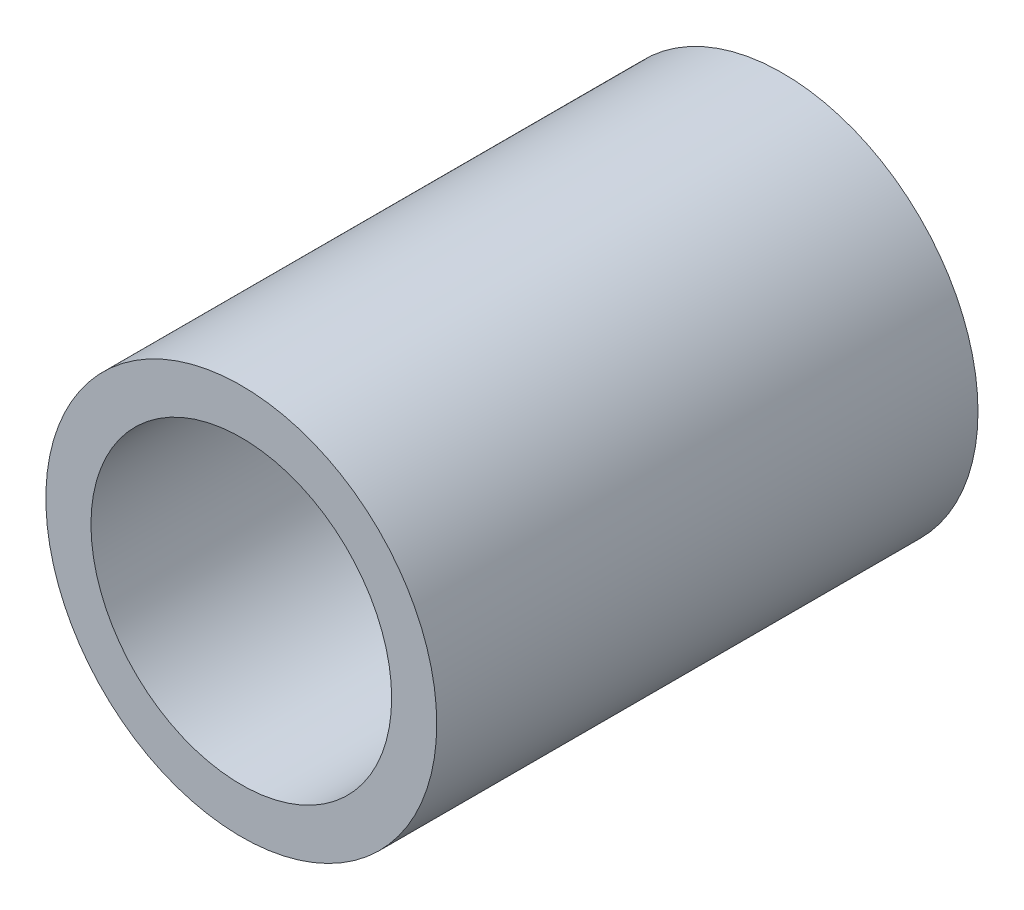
ISO-10303-21;
HEADER;
FILE_DESCRIPTION(('STEP AP214'),'2;1');
FILE_NAME('part.step','',(''),(''),'','','');
FILE_SCHEMA(('AUTOMOTIVE_DESIGN { 1 0 10303 214 1 1 1 1 }'));
ENDSEC;
DATA;
#1=APPLICATION_CONTEXT('core data for automotive mechanical design processes');
#2=APPLICATION_PROTOCOL_DEFINITION('international standard','automotive_design',2000,#1);
#3=PRODUCT_CONTEXT('',#1,'mechanical');
#4=PRODUCT('Part','Part','',(#3));
#5=PRODUCT_RELATED_PRODUCT_CATEGORY('part','',(#4));
#6=PRODUCT_DEFINITION_FORMATION('','',#4);
#7=PRODUCT_DEFINITION_CONTEXT('part definition',#1,'design');
#8=PRODUCT_DEFINITION('design','',#6,#7);
#9=PRODUCT_DEFINITION_SHAPE('','',#8);
#10=(LENGTH_UNIT() NAMED_UNIT(*) SI_UNIT(.MILLI.,.METRE.));
#11=(NAMED_UNIT(*) PLANE_ANGLE_UNIT() SI_UNIT($,.RADIAN.));
#12=(NAMED_UNIT(*) SI_UNIT($,.STERADIAN.) SOLID_ANGLE_UNIT());
#13=UNCERTAINTY_MEASURE_WITH_UNIT(LENGTH_MEASURE(1.E-05),#10,'distance_accuracy_value','');
#14=(GEOMETRIC_REPRESENTATION_CONTEXT(3) GLOBAL_UNCERTAINTY_ASSIGNED_CONTEXT((#13)) GLOBAL_UNIT_ASSIGNED_CONTEXT((#10,
#11,#12)) REPRESENTATION_CONTEXT('',''));
#15=CARTESIAN_POINT('',(0.,0.,0.));
#16=DIRECTION('',(0.,0.,1.));
#17=DIRECTION('',(1.,0.,0.));
#18=AXIS2_PLACEMENT_3D('',#15,#16,#17);
#19=CARTESIAN_POINT('',(0.,0.,9.));
#20=DIRECTION('',(0.,0.,1.));
#21=DIRECTION('',(1.,0.,0.));
#22=AXIS2_PLACEMENT_3D('',#19,#20,#21);
#23=PLANE('',#22);
#24=CARTESIAN_POINT('',(0.,0.,9.));
#25=DIRECTION('',(0.,0.,1.));
#26=DIRECTION('',(1.,0.,0.));
#27=AXIS2_PLACEMENT_3D('',#24,#25,#26);
#28=CIRCLE('',#27,3.25);
#29=CARTESIAN_POINT('',(3.25,0.,9.));
#30=VERTEX_POINT('',#29);
#31=EDGE_CURVE('E10',#30,#30,#28,.T.);
#32=ORIENTED_EDGE('',*,*,#31,.T.);
#33=EDGE_LOOP('',(#32));
#34=FACE_BOUND('',#33,.T.);
#35=CARTESIAN_POINT('',(0.,0.,9.));
#36=DIRECTION('',(0.,0.,1.));
#37=DIRECTION('',(1.,0.,0.));
#38=AXIS2_PLACEMENT_3D('',#35,#36,#37);
#39=CIRCLE('',#38,2.5);
#40=CARTESIAN_POINT('',(2.5,0.,9.));
#41=VERTEX_POINT('',#40);
#42=EDGE_CURVE('E44',#41,#41,#39,.T.);
#43=ORIENTED_EDGE('',*,*,#42,.F.);
#44=EDGE_LOOP('',(#43));
#45=FACE_BOUND('',#44,.T.);
#46=ADVANCED_FACE('F33',(#34,#45),#23,.T.);
#47=CARTESIAN_POINT('',(0.,0.,0.));
#48=DIRECTION('',(0.,0.,1.));
#49=DIRECTION('',(1.,0.,0.));
#50=AXIS2_PLACEMENT_3D('',#47,#48,#49);
#51=PLANE('',#50);
#52=CARTESIAN_POINT('',(0.,0.,0.));
#53=DIRECTION('',(0.,0.,1.));
#54=DIRECTION('',(1.,0.,0.));
#55=AXIS2_PLACEMENT_3D('',#52,#53,#54);
#56=CIRCLE('',#55,3.25);
#57=CARTESIAN_POINT('',(3.25,0.,0.));
#58=VERTEX_POINT('',#57);
#59=EDGE_CURVE('E40',#58,#58,#56,.T.);
#60=ORIENTED_EDGE('',*,*,#59,.F.);
#61=EDGE_LOOP('',(#60));
#62=FACE_BOUND('',#61,.T.);
#63=CARTESIAN_POINT('',(0.,0.,0.));
#64=DIRECTION('',(0.,0.,1.));
#65=DIRECTION('',(1.,0.,0.));
#66=AXIS2_PLACEMENT_3D('',#63,#64,#65);
#67=CIRCLE('',#66,2.5);
#68=CARTESIAN_POINT('',(2.5,0.,0.));
#69=VERTEX_POINT('',#68);
#70=EDGE_CURVE('E48',#69,#69,#67,.T.);
#71=ORIENTED_EDGE('',*,*,#70,.T.);
#72=EDGE_LOOP('',(#71));
#73=FACE_BOUND('',#72,.T.);
#74=ADVANCED_FACE('F54',(#62,#73),#51,.F.);
#75=CARTESIAN_POINT('',(0.,0.,9.));
#76=DIRECTION('',(0.,0.,-1.));
#77=DIRECTION('',(-1.,0.,0.));
#78=AXIS2_PLACEMENT_3D('',#75,#76,#77);
#79=CYLINDRICAL_SURFACE('',#78,3.25);
#80=ORIENTED_EDGE('',*,*,#31,.F.);
#81=EDGE_LOOP('',(#80));
#82=FACE_BOUND('',#81,.T.);
#83=ORIENTED_EDGE('',*,*,#59,.T.);
#84=EDGE_LOOP('',(#83));
#85=FACE_BOUND('',#84,.T.);
#86=ADVANCED_FACE('F35',(#82,#85),#79,.T.);
#87=CARTESIAN_POINT('',(0.,0.,9.));
#88=DIRECTION('',(0.,0.,-1.));
#89=DIRECTION('',(-1.,0.,0.));
#90=AXIS2_PLACEMENT_3D('',#87,#88,#89);
#91=CYLINDRICAL_SURFACE('',#90,2.5);
#92=ORIENTED_EDGE('',*,*,#42,.T.);
#93=EDGE_LOOP('',(#92));
#94=FACE_BOUND('',#93,.T.);
#95=ORIENTED_EDGE('',*,*,#70,.F.);
#96=EDGE_LOOP('',(#95));
#97=FACE_BOUND('',#96,.T.);
#98=ADVANCED_FACE('F56',(#94,#97),#91,.F.);
#99=CLOSED_SHELL('',(#46,#74,#86,#98));
#100=MANIFOLD_SOLID_BREP('B2',#99);
#101=ADVANCED_BREP_SHAPE_REPRESENTATION('',(#18,#100),#14);
#102=SHAPE_DEFINITION_REPRESENTATION(#9,#101);
ENDSEC;
END-ISO-10303-21;
